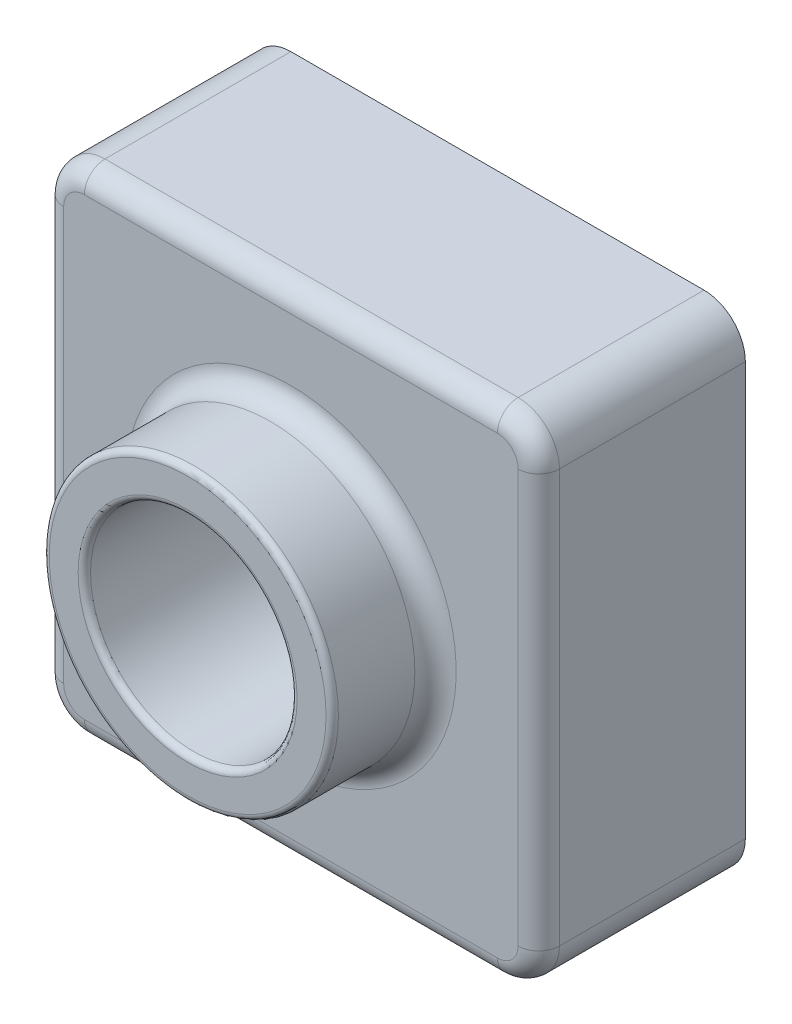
from build123d import *

# Parameters (mm, degrees)
SKETCH1_W           = 120
SKETCH1_H           = 120
BOSS_EXTRUDE1_DEPTH = 50
SKETCH2_R           = 35
BOSS_EXTRUDE2_DEPTH = 25
SKETCH3_R           = 25
CUT_EXTRUDE1_DEPTH  = 186.539753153
FILLET1_R           = 10
FILLET2_R           = 1.5
FILLET3_R           = 5
SHELL1_T            = -2


with BuildPart() as part:
    # Sketch1 → Boss-Extrude1 (new body)
    with BuildSketch(Plane.XY):
        with Locations((60, 60)):
            Rectangle(SKETCH1_W, SKETCH1_H)
    extrude(amount=BOSS_EXTRUDE1_DEPTH)

    # Sketch2 → Boss-Extrude2 (add)
    with BuildSketch(Plane.XY.offset(50)):
        with Locations(Location((60, 60, 0), (0, 0, 180))):
            Circle(SKETCH2_R)
    extrude(amount=BOSS_EXTRUDE2_DEPTH)

    # Sketch3 → Cut-Extrude1 (cut, through all)
    with BuildSketch(Plane.XY.offset(75)):
        with Locations((60, 60)):
            Circle(SKETCH3_R)
    extrude(amount=-CUT_EXTRUDE1_DEPTH, mode=Mode.SUBTRACT)

    # Fillet1
    fillet1_edges = [part.edges().sort_by_distance(p)[0] for p in [
        (0, 120, 25),
        (120, 120, 25),
        (120, 0, 25),
        (0, 0, 25),
    ]]
    fillet(fillet1_edges, radius=FILLET1_R)

    # Fillet2
    fillet2_edges = [part.edges().sort_by_distance(p)[0] for p in [
        (95, 60, 75),
        (35, 60, 75),
    ]]
    fillet(fillet2_edges, radius=FILLET2_R)

    # Fillet3
    fillet3_edges = [part.edges().sort_by_distance(p)[0] for p in [
        (95, 60, 50),
        (60, 0, 50),
        (0, 60, 50),
        (120, 60, 50),
        (60, 120, 50),
        (2.928932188, 117.071067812, 50),
        (117.071067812, 117.071067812, 50),
        (117.071067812, 2.928932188, 50),
        (2.928932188, 2.928932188, 50),
    ]]
    fillet(fillet3_edges, radius=FILLET3_R)

    # Shell1
    shell1_openings = [part.faces().sort_by_distance(p)[0] for p in [
        (60, 1.697056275, 0),
    ]]
    offset(amount=SHELL1_T, openings=shell1_openings, kind=Kind.INTERSECTION)


solid = part.part
